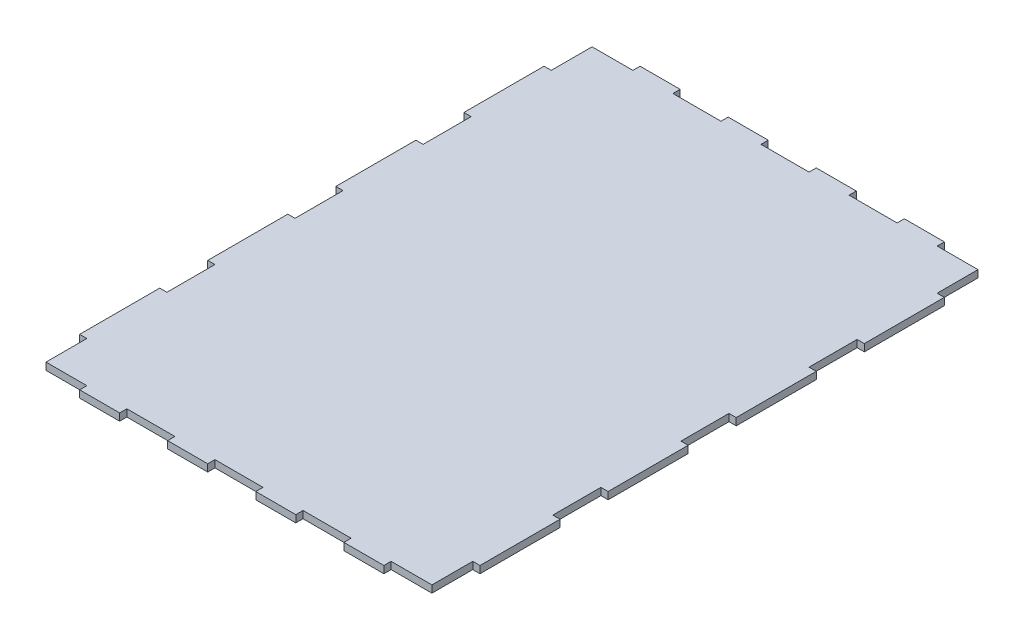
from build123d import *

# Parameters (mm, degrees)
SKETCH1_W           = 482
SKETCH1_H           = 682
BOSS_EXTRUDE1_DEPTH = 9
SKETCH3_W           = 50
SKETCH3_H           = 9
BOSS_EXTRUDE2_DEPTH = 9
SKETCH4_W           = 9
SKETCH4_H           = 100
BOSS_EXTRUDE3_DEPTH = 9


with BuildPart() as part:
    # Sketch1 → Boss-Extrude1 (new body)
    with BuildSketch(Plane(origin=(0, 0, 0), x_dir=(1, 0, 0), z_dir=(0, 1, 0))):
        Rectangle(SKETCH1_W, SKETCH1_H)
    extrude(amount=BOSS_EXTRUDE1_DEPTH)

    # Sketch3 → Boss-Extrude2 (add)
    with BuildSketch(Plane(origin=(0, 9, 0), x_dir=(1, 0, 0), z_dir=(0, 1, 0))):
        with Locations((-165, 345.5)):
            Rectangle(SKETCH3_W, SKETCH3_H)
        with Locations((-55, 345.5)):
            Rectangle(SKETCH3_W, SKETCH3_H)
        with Locations((55, 345.5)):
            Rectangle(SKETCH3_W, SKETCH3_H)
        with Locations((165, 345.5)):
            Rectangle(SKETCH3_W, SKETCH3_H)
        with Locations((-165, -345.5)):
            Rectangle(SKETCH3_W, SKETCH3_H)
        with Locations((165, -345.5)):
            Rectangle(SKETCH3_W, SKETCH3_H)
        with Locations((55, -345.5)):
            Rectangle(SKETCH3_W, SKETCH3_H)
        with Locations((-55, -345.5)):
            Rectangle(SKETCH3_W, SKETCH3_H)
    extrude(amount=-BOSS_EXTRUDE2_DEPTH)

    # Sketch4 → Boss-Extrude3 (add)
    with BuildSketch(Plane(origin=(0, 9, 0), x_dir=(1, 0, 0), z_dir=(0, 1, 0))):
        with Locations((-245.5, 240)):
            Rectangle(SKETCH4_W, SKETCH4_H)
        with Locations((245.5, 240)):
            Rectangle(SKETCH4_W, SKETCH4_H)
        with Locations((-245.5, 80)):
            Rectangle(SKETCH4_W, SKETCH4_H)
        with Locations((245.5, 80)):
            Rectangle(SKETCH4_W, SKETCH4_H)
        with Locations((-245.5, -80)):
            Rectangle(SKETCH4_W, SKETCH4_H)
        with Locations((245.5, -80)):
            Rectangle(SKETCH4_W, SKETCH4_H)
        with Locations((-245.5, -240)):
            Rectangle(SKETCH4_W, SKETCH4_H)
        with Locations((245.5, -240)):
            Rectangle(SKETCH4_W, SKETCH4_H)
    extrude(amount=-BOSS_EXTRUDE3_DEPTH)


solid = part.part
